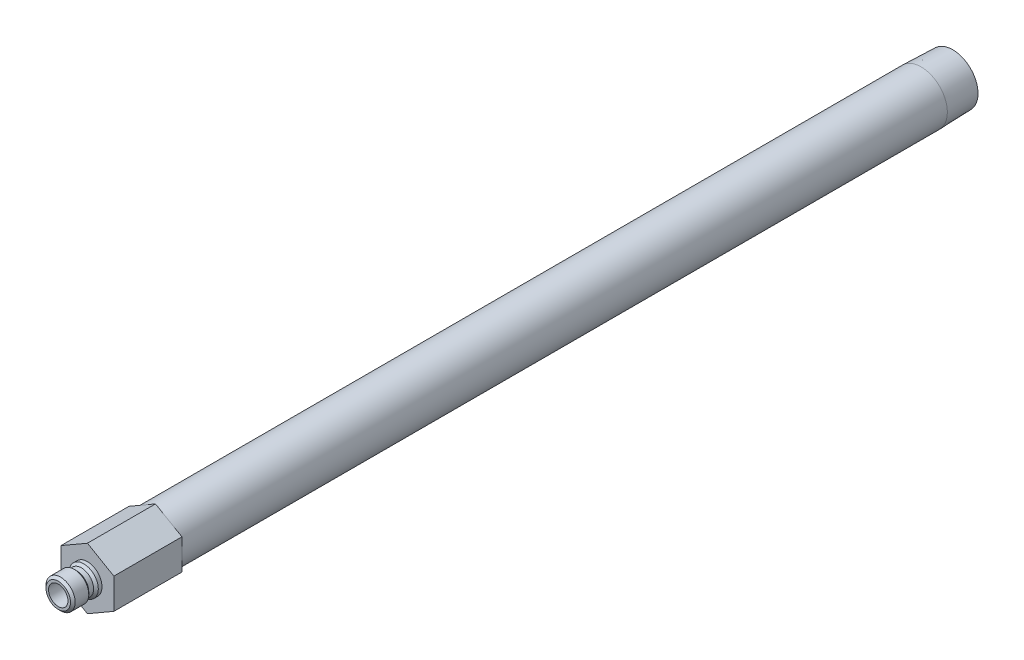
ISO-10303-21;
HEADER;
FILE_DESCRIPTION(('STEP AP214'),'2;1');
FILE_NAME('part.step','',(''),(''),'','','');
FILE_SCHEMA(('AUTOMOTIVE_DESIGN { 1 0 10303 214 1 1 1 1 }'));
ENDSEC;
DATA;
#1=APPLICATION_CONTEXT('core data for automotive mechanical design processes');
#2=APPLICATION_PROTOCOL_DEFINITION('international standard','automotive_design',2000,#1);
#3=PRODUCT_CONTEXT('',#1,'mechanical');
#4=PRODUCT('Part','Part','',(#3));
#5=PRODUCT_RELATED_PRODUCT_CATEGORY('part','',(#4));
#6=PRODUCT_DEFINITION_FORMATION('','',#4);
#7=PRODUCT_DEFINITION_CONTEXT('part definition',#1,'design');
#8=PRODUCT_DEFINITION('design','',#6,#7);
#9=PRODUCT_DEFINITION_SHAPE('','',#8);
#10=(LENGTH_UNIT() NAMED_UNIT(*) SI_UNIT(.MILLI.,.METRE.));
#11=(NAMED_UNIT(*) PLANE_ANGLE_UNIT() SI_UNIT($,.RADIAN.));
#12=(NAMED_UNIT(*) SI_UNIT($,.STERADIAN.) SOLID_ANGLE_UNIT());
#13=UNCERTAINTY_MEASURE_WITH_UNIT(LENGTH_MEASURE(1.E-05),#10,'distance_accuracy_value','');
#14=(GEOMETRIC_REPRESENTATION_CONTEXT(3) GLOBAL_UNCERTAINTY_ASSIGNED_CONTEXT((#13)) GLOBAL_UNIT_ASSIGNED_CONTEXT((#10,
#11,#12)) REPRESENTATION_CONTEXT('',''));
#15=CARTESIAN_POINT('',(0.,0.,0.));
#16=DIRECTION('',(0.,0.,1.));
#17=DIRECTION('',(1.,0.,0.));
#18=AXIS2_PLACEMENT_3D('',#15,#16,#17);
#19=CARTESIAN_POINT('',(0.,0.,0.));
#20=DIRECTION('',(0.,0.,-1.));
#21=DIRECTION('',(0.,1.,0.));
#22=AXIS2_PLACEMENT_3D('',#19,#20,#21);
#23=CYLINDRICAL_SURFACE('',#22,8.57249999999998);
#24=CARTESIAN_POINT('',(0.,0.,-272.2372));
#25=DIRECTION('',(0.,0.,-1.));
#26=DIRECTION('',(0.,1.,0.));
#27=AXIS2_PLACEMENT_3D('',#24,#25,#26);
#28=CIRCLE('',#27,8.57249999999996);
#29=CARTESIAN_POINT('',(0.,8.5725,-272.2372));
#30=VERTEX_POINT('',#29);
#31=EDGE_CURVE('E168',#30,#30,#28,.T.);
#32=ORIENTED_EDGE('',*,*,#31,.F.);
#33=EDGE_LOOP('',(#32));
#34=FACE_BOUND('',#33,.T.);
#35=CARTESIAN_POINT('',(0.,0.,-22.225));
#36=DIRECTION('',(0.,0.,1.));
#37=DIRECTION('',(1.,0.,0.));
#38=AXIS2_PLACEMENT_3D('',#35,#36,#37);
#39=CIRCLE('',#38,8.57249999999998);
#40=CARTESIAN_POINT('',(8.57249999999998,0.,-22.225));
#41=VERTEX_POINT('',#40);
#42=EDGE_CURVE('E37',#41,#41,#39,.F.);
#43=ORIENTED_EDGE('',*,*,#42,.T.);
#44=EDGE_LOOP('',(#43));
#45=FACE_BOUND('',#44,.T.);
#46=ADVANCED_FACE('F33',(#34,#45),#23,.T.);
#47=CARTESIAN_POINT('',(0.,0.,0.));
#48=DIRECTION('',(0.,0.,-1.));
#49=DIRECTION('',(0.,1.,0.));
#50=AXIS2_PLACEMENT_3D('',#47,#48,#49);
#51=CYLINDRICAL_SURFACE('',#50,3.175);
#52=CARTESIAN_POINT('',(0.,0.,9.525));
#53=DIRECTION('',(0.,0.,-1.));
#54=DIRECTION('',(0.,1.,0.));
#55=AXIS2_PLACEMENT_3D('',#52,#53,#54);
#56=CIRCLE('',#55,3.175);
#57=CARTESIAN_POINT('',(0.,3.175,9.525));
#58=VERTEX_POINT('',#57);
#59=EDGE_CURVE('E144',#58,#58,#56,.T.);
#60=ORIENTED_EDGE('',*,*,#59,.F.);
#61=EDGE_LOOP('',(#60));
#62=FACE_BOUND('',#61,.T.);
#63=CARTESIAN_POINT('',(0.,0.,-22.225));
#64=DIRECTION('',(0.,0.,-1.));
#65=DIRECTION('',(0.,1.,0.));
#66=AXIS2_PLACEMENT_3D('',#63,#64,#65);
#67=CIRCLE('',#66,3.17499999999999);
#68=CARTESIAN_POINT('',(0.,3.175,-22.225));
#69=VERTEX_POINT('',#68);
#70=EDGE_CURVE('E11',#69,#69,#67,.T.);
#71=ORIENTED_EDGE('',*,*,#70,.T.);
#72=EDGE_LOOP('',(#71));
#73=FACE_BOUND('',#72,.T.);
#74=ADVANCED_FACE('F35',(#62,#73),#51,.F.);
#75=CARTESIAN_POINT('',(0.,3.175,-22.225));
#76=DIRECTION('',(0.,0.,-1.));
#77=DIRECTION('',(0.,1.,0.));
#78=AXIS2_PLACEMENT_3D('',#75,#76,#77);
#79=PLANE('',#78);
#80=CARTESIAN_POINT('',(0.,0.,-22.225));
#81=DIRECTION('',(0.,0.,-1.));
#82=DIRECTION('',(0.,1.,0.));
#83=AXIS2_PLACEMENT_3D('',#80,#81,#82);
#84=CIRCLE('',#83,6.2611);
#85=CARTESIAN_POINT('',(0.,6.2611,-22.225));
#86=VERTEX_POINT('',#85);
#87=EDGE_CURVE('E43',#86,#86,#84,.T.);
#88=ORIENTED_EDGE('',*,*,#87,.T.);
#89=EDGE_LOOP('',(#88));
#90=FACE_BOUND('',#89,.T.);
#91=ORIENTED_EDGE('',*,*,#70,.F.);
#92=EDGE_LOOP('',(#91));
#93=FACE_BOUND('',#92,.T.);
#94=ADVANCED_FACE('F180',(#90,#93),#79,.T.);
#95=CARTESIAN_POINT('',(0.,0.,0.));
#96=DIRECTION('',(0.,0.,-1.));
#97=DIRECTION('',(0.,1.,0.));
#98=AXIS2_PLACEMENT_3D('',#95,#96,#97);
#99=CYLINDRICAL_SURFACE('',#98,6.26109999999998);
#100=CARTESIAN_POINT('',(0.,0.,-282.575));
#101=DIRECTION('',(0.,0.,-1.));
#102=DIRECTION('',(0.,1.,0.));
#103=AXIS2_PLACEMENT_3D('',#100,#101,#102);
#104=CIRCLE('',#103,6.26109999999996);
#105=CARTESIAN_POINT('',(0.,6.2611,-282.575));
#106=VERTEX_POINT('',#105);
#107=EDGE_CURVE('E174',#106,#106,#104,.T.);
#108=ORIENTED_EDGE('',*,*,#107,.T.);
#109=EDGE_LOOP('',(#108));
#110=FACE_BOUND('',#109,.T.);
#111=ORIENTED_EDGE('',*,*,#87,.F.);
#112=EDGE_LOOP('',(#111));
#113=FACE_BOUND('',#112,.T.);
#114=ADVANCED_FACE('F183',(#110,#113),#99,.F.);
#115=CARTESIAN_POINT('',(0.,8.24944566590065,-282.575));
#116=DIRECTION('',(0.,0.,-1.));
#117=DIRECTION('',(0.,1.,0.));
#118=AXIS2_PLACEMENT_3D('',#115,#116,#117);
#119=PLANE('',#118);
#120=CARTESIAN_POINT('',(0.,0.,-282.575));
#121=DIRECTION('',(0.,0.,-1.));
#122=DIRECTION('',(0.,1.,0.));
#123=AXIS2_PLACEMENT_3D('',#120,#121,#122);
#124=CIRCLE('',#123,8.24944566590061);
#125=CARTESIAN_POINT('',(0.,8.24944566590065,-282.575));
#126=VERTEX_POINT('',#125);
#127=EDGE_CURVE('E171',#126,#126,#124,.T.);
#128=ORIENTED_EDGE('',*,*,#127,.T.);
#129=EDGE_LOOP('',(#128));
#130=FACE_BOUND('',#129,.T.);
#131=ORIENTED_EDGE('',*,*,#107,.F.);
#132=EDGE_LOOP('',(#131));
#133=FACE_BOUND('',#132,.T.);
#134=ADVANCED_FACE('F185',(#130,#133),#119,.T.);
#135=CARTESIAN_POINT('',(0.,0.,-282.575));
#136=DIRECTION('',(0.,0.,1.));
#137=DIRECTION('',(0.,-1.,0.));
#138=AXIS2_PLACEMENT_3D('',#135,#136,#137);
#139=CONICAL_SURFACE('',#138,8.24944566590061,0.0312396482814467);
#140=ORIENTED_EDGE('',*,*,#31,.T.);
#141=EDGE_LOOP('',(#140));
#142=FACE_BOUND('',#141,.T.);
#143=ORIENTED_EDGE('',*,*,#127,.F.);
#144=EDGE_LOOP('',(#143));
#145=FACE_BOUND('',#144,.T.);
#146=ADVANCED_FACE('F192',(#142,#145),#139,.T.);
#147=CARTESIAN_POINT('',(0.,4.7625,0.));
#148=DIRECTION('',(0.,0.,1.));
#149=DIRECTION('',(0.,-1.,0.));
#150=AXIS2_PLACEMENT_3D('',#147,#148,#149);
#151=PLANE('',#150);
#152=CARTESIAN_POINT('',(0.,0.,0.));
#153=DIRECTION('',(0.,0.,-1.));
#154=DIRECTION('',(0.,1.,0.));
#155=AXIS2_PLACEMENT_3D('',#152,#153,#154);
#156=CIRCLE('',#155,4.7625);
#157=CARTESIAN_POINT('',(0.,4.7625,0.));
#158=VERTEX_POINT('',#157);
#159=EDGE_CURVE('E165',#158,#158,#156,.T.);
#160=ORIENTED_EDGE('',*,*,#159,.T.);
#161=EDGE_LOOP('',(#160));
#162=FACE_BOUND('',#161,.T.);
#163=DIRECTION('',(-0.866025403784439,-0.5,0.));
#164=VECTOR('',#163,1.);
#165=CARTESIAN_POINT('',(0.,9.97199384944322,0.));
#166=LINE('',#165,#164);
#167=CARTESIAN_POINT('',(0.,9.97199384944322,0.));
#168=VERTEX_POINT('',#167);
#169=CARTESIAN_POINT('',(-8.636,4.98599692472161,0.));
#170=VERTEX_POINT('',#169);
#171=EDGE_CURVE('E122',#168,#170,#166,.T.);
#172=ORIENTED_EDGE('',*,*,#171,.T.);
#173=DIRECTION('',(0.,-1.,0.));
#174=VECTOR('',#173,1.);
#175=CARTESIAN_POINT('',(-8.636,4.98599692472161,0.));
#176=LINE('',#175,#174);
#177=CARTESIAN_POINT('',(-8.636,-4.98599692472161,0.));
#178=VERTEX_POINT('',#177);
#179=EDGE_CURVE('E125',#170,#178,#176,.T.);
#180=ORIENTED_EDGE('',*,*,#179,.T.);
#181=DIRECTION('',(0.866025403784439,-0.5,0.));
#182=VECTOR('',#181,1.);
#183=CARTESIAN_POINT('',(-8.636,-4.98599692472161,0.));
#184=LINE('',#183,#182);
#185=CARTESIAN_POINT('',(0.,-9.97199384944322,0.));
#186=VERTEX_POINT('',#185);
#187=EDGE_CURVE('E128',#178,#186,#184,.T.);
#188=ORIENTED_EDGE('',*,*,#187,.T.);
#189=DIRECTION('',(0.866025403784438,0.5,0.));
#190=VECTOR('',#189,1.);
#191=CARTESIAN_POINT('',(0.,-9.97199384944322,0.));
#192=LINE('',#191,#190);
#193=CARTESIAN_POINT('',(8.636,-4.98599692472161,0.));
#194=VERTEX_POINT('',#193);
#195=EDGE_CURVE('E131',#186,#194,#192,.T.);
#196=ORIENTED_EDGE('',*,*,#195,.T.);
#197=DIRECTION('',(0.,1.,0.));
#198=VECTOR('',#197,1.);
#199=CARTESIAN_POINT('',(8.636,-4.98599692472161,0.));
#200=LINE('',#199,#198);
#201=CARTESIAN_POINT('',(8.636,4.98599692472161,0.));
#202=VERTEX_POINT('',#201);
#203=EDGE_CURVE('E99',#194,#202,#200,.T.);
#204=ORIENTED_EDGE('',*,*,#203,.T.);
#205=DIRECTION('',(-0.866025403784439,0.5,0.));
#206=VECTOR('',#205,1.);
#207=CARTESIAN_POINT('',(8.636,4.98599692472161,0.));
#208=LINE('',#207,#206);
#209=EDGE_CURVE('E134',#202,#168,#208,.T.);
#210=ORIENTED_EDGE('',*,*,#209,.T.);
#211=EDGE_LOOP('',(#172,#180,#188,#196,#204,#210));
#212=FACE_BOUND('',#211,.T.);
#213=ADVANCED_FACE('F206',(#162,#212),#151,.T.);
#214=CARTESIAN_POINT('',(0.,0.,0.));
#215=DIRECTION('',(0.,0.,-1.));
#216=DIRECTION('',(0.,1.,0.));
#217=AXIS2_PLACEMENT_3D('',#214,#215,#216);
#218=CYLINDRICAL_SURFACE('',#217,4.7625);
#219=CARTESIAN_POINT('',(0.,0.,1.2065));
#220=DIRECTION('',(0.,0.,-1.));
#221=DIRECTION('',(0.,1.,0.));
#222=AXIS2_PLACEMENT_3D('',#219,#220,#221);
#223=CIRCLE('',#222,4.7625);
#224=CARTESIAN_POINT('',(0.,4.7625,1.2065));
#225=VERTEX_POINT('',#224);
#226=EDGE_CURVE('E162',#225,#225,#223,.T.);
#227=ORIENTED_EDGE('',*,*,#226,.T.);
#228=EDGE_LOOP('',(#227));
#229=FACE_BOUND('',#228,.T.);
#230=ORIENTED_EDGE('',*,*,#159,.F.);
#231=EDGE_LOOP('',(#230));
#232=FACE_BOUND('',#231,.T.);
#233=ADVANCED_FACE('F213',(#229,#232),#218,.T.);
#234=CARTESIAN_POINT('',(0.,0.,1.2065));
#235=DIRECTION('',(0.,0.,-1.));
#236=DIRECTION('',(0.,1.,0.));
#237=AXIS2_PLACEMENT_3D('',#234,#235,#236);
#238=CONICAL_SURFACE('',#237,4.7625,0.785398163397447);
#239=CARTESIAN_POINT('',(0.,0.,1.9685));
#240=DIRECTION('',(0.,0.,-1.));
#241=DIRECTION('',(0.,1.,0.));
#242=AXIS2_PLACEMENT_3D('',#239,#240,#241);
#243=CIRCLE('',#242,4.0005);
#244=CARTESIAN_POINT('',(0.,4.0005,1.9685));
#245=VERTEX_POINT('',#244);
#246=EDGE_CURVE('E159',#245,#245,#243,.T.);
#247=ORIENTED_EDGE('',*,*,#246,.T.);
#248=EDGE_LOOP('',(#247));
#249=FACE_BOUND('',#248,.T.);
#250=ORIENTED_EDGE('',*,*,#226,.F.);
#251=EDGE_LOOP('',(#250));
#252=FACE_BOUND('',#251,.T.);
#253=ADVANCED_FACE('F222',(#249,#252),#238,.T.);
#254=CARTESIAN_POINT('',(0.,0.,0.));
#255=DIRECTION('',(0.,0.,-1.));
#256=DIRECTION('',(0.,1.,0.));
#257=AXIS2_PLACEMENT_3D('',#254,#255,#256);
#258=CYLINDRICAL_SURFACE('',#257,4.0005);
#259=CARTESIAN_POINT('',(0.,0.,3.556));
#260=DIRECTION('',(0.,0.,-1.));
#261=DIRECTION('',(0.,1.,0.));
#262=AXIS2_PLACEMENT_3D('',#259,#260,#261);
#263=CIRCLE('',#262,4.0005);
#264=CARTESIAN_POINT('',(0.,4.0005,3.556));
#265=VERTEX_POINT('',#264);
#266=EDGE_CURVE('E156',#265,#265,#263,.T.);
#267=ORIENTED_EDGE('',*,*,#266,.T.);
#268=EDGE_LOOP('',(#267));
#269=FACE_BOUND('',#268,.T.);
#270=ORIENTED_EDGE('',*,*,#246,.F.);
#271=EDGE_LOOP('',(#270));
#272=FACE_BOUND('',#271,.T.);
#273=ADVANCED_FACE('F263',(#269,#272),#258,.T.);
#274=CARTESIAN_POINT('',(0.,0.,3.556));
#275=DIRECTION('',(0.,0.,1.));
#276=DIRECTION('',(0.,-1.,0.));
#277=AXIS2_PLACEMENT_3D('',#274,#275,#276);
#278=CONICAL_SURFACE('',#277,4.0005,0.785398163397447);
#279=CARTESIAN_POINT('',(0.,0.,4.318));
#280=DIRECTION('',(0.,0.,-1.));
#281=DIRECTION('',(0.,1.,0.));
#282=AXIS2_PLACEMENT_3D('',#279,#280,#281);
#283=CIRCLE('',#282,4.7625);
#284=CARTESIAN_POINT('',(0.,4.7625,4.318));
#285=VERTEX_POINT('',#284);
#286=EDGE_CURVE('E153',#285,#285,#283,.T.);
#287=ORIENTED_EDGE('',*,*,#286,.T.);
#288=EDGE_LOOP('',(#287));
#289=FACE_BOUND('',#288,.T.);
#290=ORIENTED_EDGE('',*,*,#266,.F.);
#291=EDGE_LOOP('',(#290));
#292=FACE_BOUND('',#291,.T.);
#293=ADVANCED_FACE('F259',(#289,#292),#278,.T.);
#294=CARTESIAN_POINT('',(0.,0.,0.));
#295=DIRECTION('',(0.,0.,-1.));
#296=DIRECTION('',(0.,1.,0.));
#297=AXIS2_PLACEMENT_3D('',#294,#295,#296);
#298=CYLINDRICAL_SURFACE('',#297,4.7625);
#299=CARTESIAN_POINT('',(0.,0.,8.763));
#300=DIRECTION('',(0.,0.,-1.));
#301=DIRECTION('',(0.,1.,0.));
#302=AXIS2_PLACEMENT_3D('',#299,#300,#301);
#303=CIRCLE('',#302,4.7625);
#304=CARTESIAN_POINT('',(0.,4.7625,8.763));
#305=VERTEX_POINT('',#304);
#306=EDGE_CURVE('E150',#305,#305,#303,.T.);
#307=ORIENTED_EDGE('',*,*,#306,.T.);
#308=EDGE_LOOP('',(#307));
#309=FACE_BOUND('',#308,.T.);
#310=ORIENTED_EDGE('',*,*,#286,.F.);
#311=EDGE_LOOP('',(#310));
#312=FACE_BOUND('',#311,.T.);
#313=ADVANCED_FACE('F255',(#309,#312),#298,.T.);
#314=CARTESIAN_POINT('',(0.,0.,8.763));
#315=DIRECTION('',(0.,0.,-1.));
#316=DIRECTION('',(0.,1.,0.));
#317=AXIS2_PLACEMENT_3D('',#314,#315,#316);
#318=CONICAL_SURFACE('',#317,4.7625,0.785398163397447);
#319=CARTESIAN_POINT('',(0.,0.,9.525));
#320=DIRECTION('',(0.,0.,-1.));
#321=DIRECTION('',(0.,1.,0.));
#322=AXIS2_PLACEMENT_3D('',#319,#320,#321);
#323=CIRCLE('',#322,4.0005);
#324=CARTESIAN_POINT('',(0.,4.0005,9.525));
#325=VERTEX_POINT('',#324);
#326=EDGE_CURVE('E147',#325,#325,#323,.T.);
#327=ORIENTED_EDGE('',*,*,#326,.T.);
#328=EDGE_LOOP('',(#327));
#329=FACE_BOUND('',#328,.T.);
#330=ORIENTED_EDGE('',*,*,#306,.F.);
#331=EDGE_LOOP('',(#330));
#332=FACE_BOUND('',#331,.T.);
#333=ADVANCED_FACE('F251',(#329,#332),#318,.T.);
#334=CARTESIAN_POINT('',(0.,3.175,9.525));
#335=DIRECTION('',(0.,0.,1.));
#336=DIRECTION('',(0.,-1.,0.));
#337=AXIS2_PLACEMENT_3D('',#334,#335,#336);
#338=PLANE('',#337);
#339=ORIENTED_EDGE('',*,*,#59,.T.);
#340=EDGE_LOOP('',(#339));
#341=FACE_BOUND('',#340,.T.);
#342=ORIENTED_EDGE('',*,*,#326,.F.);
#343=EDGE_LOOP('',(#342));
#344=FACE_BOUND('',#343,.T.);
#345=ADVANCED_FACE('F239',(#341,#344),#338,.T.);
#346=CARTESIAN_POINT('',(0.,9.97199384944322,-22.225));
#347=DIRECTION('',(-0.5,0.866025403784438,0.));
#348=DIRECTION('',(-0.866025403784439,-0.5,0.));
#349=AXIS2_PLACEMENT_3D('',#346,#347,#348);
#350=PLANE('',#349);
#351=ORIENTED_EDGE('',*,*,#171,.F.);
#352=DIRECTION('',(0.,0.,1.));
#353=VECTOR('',#352,1.);
#354=CARTESIAN_POINT('',(0.,9.97199384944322,-22.225));
#355=LINE('',#354,#353);
#356=CARTESIAN_POINT('',(0.,9.97199384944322,-22.225));
#357=VERTEX_POINT('',#356);
#358=EDGE_CURVE('E51',#357,#168,#355,.T.);
#359=ORIENTED_EDGE('',*,*,#358,.F.);
#360=DIRECTION('',(-0.866025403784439,-0.5,0.));
#361=VECTOR('',#360,1.);
#362=CARTESIAN_POINT('',(0.,9.97199384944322,-22.225));
#363=LINE('',#362,#361);
#364=CARTESIAN_POINT('',(-8.636,4.98599692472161,-22.225));
#365=VERTEX_POINT('',#364);
#366=EDGE_CURVE('E137',#357,#365,#363,.T.);
#367=ORIENTED_EDGE('',*,*,#366,.T.);
#368=DIRECTION('',(0.,0.,1.));
#369=VECTOR('',#368,1.);
#370=CARTESIAN_POINT('',(-8.636,4.98599692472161,-22.225));
#371=LINE('',#370,#369);
#372=EDGE_CURVE('E86',#365,#170,#371,.T.);
#373=ORIENTED_EDGE('',*,*,#372,.T.);
#374=EDGE_LOOP('',(#351,#359,#367,#373));
#375=FACE_BOUND('',#374,.T.);
#376=ADVANCED_FACE('F226',(#375),#350,.T.);
#377=CARTESIAN_POINT('',(8.636,4.98599692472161,-22.225));
#378=DIRECTION('',(0.5,0.866025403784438,0.));
#379=DIRECTION('',(-0.866025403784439,0.5,0.));
#380=AXIS2_PLACEMENT_3D('',#377,#378,#379);
#381=PLANE('',#380);
#382=ORIENTED_EDGE('',*,*,#209,.F.);
#383=DIRECTION('',(0.,0.,1.));
#384=VECTOR('',#383,1.);
#385=CARTESIAN_POINT('',(8.636,4.98599692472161,-22.225));
#386=LINE('',#385,#384);
#387=CARTESIAN_POINT('',(8.636,4.98599692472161,-22.225));
#388=VERTEX_POINT('',#387);
#389=EDGE_CURVE('E74',#388,#202,#386,.T.);
#390=ORIENTED_EDGE('',*,*,#389,.F.);
#391=DIRECTION('',(-0.866025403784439,0.5,0.));
#392=VECTOR('',#391,1.);
#393=CARTESIAN_POINT('',(8.636,4.98599692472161,-22.225));
#394=LINE('',#393,#392);
#395=EDGE_CURVE('E112',#388,#357,#394,.T.);
#396=ORIENTED_EDGE('',*,*,#395,.T.);
#397=ORIENTED_EDGE('',*,*,#358,.T.);
#398=EDGE_LOOP('',(#382,#390,#396,#397));
#399=FACE_BOUND('',#398,.T.);
#400=ADVANCED_FACE('F231',(#399),#381,.T.);
#401=CARTESIAN_POINT('',(8.636,-4.98599692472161,-22.225));
#402=DIRECTION('',(1.,0.,0.));
#403=DIRECTION('',(0.,1.,0.));
#404=AXIS2_PLACEMENT_3D('',#401,#402,#403);
#405=PLANE('',#404);
#406=ORIENTED_EDGE('',*,*,#203,.F.);
#407=DIRECTION('',(0.,0.,1.));
#408=VECTOR('',#407,1.);
#409=CARTESIAN_POINT('',(8.636,-4.98599692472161,-22.225));
#410=LINE('',#409,#408);
#411=CARTESIAN_POINT('',(8.636,-4.98599692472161,-22.225));
#412=VERTEX_POINT('',#411);
#413=EDGE_CURVE('E94',#412,#194,#410,.T.);
#414=ORIENTED_EDGE('',*,*,#413,.F.);
#415=DIRECTION('',(0.,1.,0.));
#416=VECTOR('',#415,1.);
#417=CARTESIAN_POINT('',(8.636,-4.98599692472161,-22.225));
#418=LINE('',#417,#416);
#419=EDGE_CURVE('E97',#412,#388,#418,.T.);
#420=ORIENTED_EDGE('',*,*,#419,.T.);
#421=ORIENTED_EDGE('',*,*,#389,.T.);
#422=EDGE_LOOP('',(#406,#414,#420,#421));
#423=FACE_BOUND('',#422,.T.);
#424=ADVANCED_FACE('F96',(#423),#405,.T.);
#425=CARTESIAN_POINT('',(0.,-9.97199384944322,-22.225));
#426=DIRECTION('',(0.5,-0.866025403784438,0.));
#427=DIRECTION('',(0.866025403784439,0.5,0.));
#428=AXIS2_PLACEMENT_3D('',#425,#426,#427);
#429=PLANE('',#428);
#430=ORIENTED_EDGE('',*,*,#195,.F.);
#431=DIRECTION('',(0.,0.,1.));
#432=VECTOR('',#431,1.);
#433=CARTESIAN_POINT('',(0.,-9.97199384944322,-22.225));
#434=LINE('',#433,#432);
#435=CARTESIAN_POINT('',(0.,-9.97199384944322,-22.225));
#436=VERTEX_POINT('',#435);
#437=EDGE_CURVE('E104',#436,#186,#434,.T.);
#438=ORIENTED_EDGE('',*,*,#437,.F.);
#439=DIRECTION('',(0.866025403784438,0.5,0.));
#440=VECTOR('',#439,1.);
#441=CARTESIAN_POINT('',(0.,-9.97199384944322,-22.225));
#442=LINE('',#441,#440);
#443=EDGE_CURVE('E110',#436,#412,#442,.T.);
#444=ORIENTED_EDGE('',*,*,#443,.T.);
#445=ORIENTED_EDGE('',*,*,#413,.T.);
#446=EDGE_LOOP('',(#430,#438,#444,#445));
#447=FACE_BOUND('',#446,.T.);
#448=ADVANCED_FACE('F114',(#447),#429,.T.);
#449=CARTESIAN_POINT('',(-8.636,-4.98599692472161,-22.225));
#450=DIRECTION('',(-0.5,-0.866025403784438,0.));
#451=DIRECTION('',(0.866025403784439,-0.5,0.));
#452=AXIS2_PLACEMENT_3D('',#449,#450,#451);
#453=PLANE('',#452);
#454=ORIENTED_EDGE('',*,*,#187,.F.);
#455=DIRECTION('',(0.,0.,1.));
#456=VECTOR('',#455,1.);
#457=CARTESIAN_POINT('',(-8.636,-4.98599692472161,-22.225));
#458=LINE('',#457,#456);
#459=CARTESIAN_POINT('',(-8.636,-4.98599692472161,-22.225));
#460=VERTEX_POINT('',#459);
#461=EDGE_CURVE('E141',#460,#178,#458,.T.);
#462=ORIENTED_EDGE('',*,*,#461,.F.);
#463=DIRECTION('',(0.866025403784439,-0.5,0.));
#464=VECTOR('',#463,1.);
#465=CARTESIAN_POINT('',(-8.636,-4.98599692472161,-22.225));
#466=LINE('',#465,#464);
#467=EDGE_CURVE('E115',#460,#436,#466,.T.);
#468=ORIENTED_EDGE('',*,*,#467,.T.);
#469=ORIENTED_EDGE('',*,*,#437,.T.);
#470=EDGE_LOOP('',(#454,#462,#468,#469));
#471=FACE_BOUND('',#470,.T.);
#472=ADVANCED_FACE('F230',(#471),#453,.T.);
#473=CARTESIAN_POINT('',(-8.636,4.98599692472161,-22.225));
#474=DIRECTION('',(-1.,0.,0.));
#475=DIRECTION('',(0.,0.,1.));
#476=AXIS2_PLACEMENT_3D('',#473,#474,#475);
#477=PLANE('',#476);
#478=ORIENTED_EDGE('',*,*,#179,.F.);
#479=ORIENTED_EDGE('',*,*,#372,.F.);
#480=DIRECTION('',(0.,-1.,0.));
#481=VECTOR('',#480,1.);
#482=CARTESIAN_POINT('',(-8.636,4.98599692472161,-22.225));
#483=LINE('',#482,#481);
#484=EDGE_CURVE('E117',#365,#460,#483,.T.);
#485=ORIENTED_EDGE('',*,*,#484,.T.);
#486=ORIENTED_EDGE('',*,*,#461,.T.);
#487=EDGE_LOOP('',(#478,#479,#485,#486));
#488=FACE_BOUND('',#487,.T.);
#489=ADVANCED_FACE('F227',(#488),#477,.T.);
#490=CARTESIAN_POINT('',(-8.636,4.98599692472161,-22.225));
#491=DIRECTION('',(0.,0.,1.));
#492=DIRECTION('',(1.,0.,0.));
#493=AXIS2_PLACEMENT_3D('',#490,#491,#492);
#494=PLANE('',#493);
#495=ORIENTED_EDGE('',*,*,#42,.F.);
#496=EDGE_LOOP('',(#495));
#497=FACE_BOUND('',#496,.T.);
#498=ORIENTED_EDGE('',*,*,#366,.F.);
#499=ORIENTED_EDGE('',*,*,#395,.F.);
#500=ORIENTED_EDGE('',*,*,#419,.F.);
#501=ORIENTED_EDGE('',*,*,#443,.F.);
#502=ORIENTED_EDGE('',*,*,#467,.F.);
#503=ORIENTED_EDGE('',*,*,#484,.F.);
#504=EDGE_LOOP('',(#498,#499,#500,#501,#502,#503));
#505=FACE_BOUND('',#504,.T.);
#506=ADVANCED_FACE('F108',(#497,#505),#494,.F.);
#507=CLOSED_SHELL('',(#46,#74,#94,#114,#134,#146,#213,#233,#253,#273,#293,#313,#333,#345,#376,
#400,#424,#448,#472,#489,#506));
#508=MANIFOLD_SOLID_BREP('B2',#507);
#509=ADVANCED_BREP_SHAPE_REPRESENTATION('',(#18,#508),#14);
#510=SHAPE_DEFINITION_REPRESENTATION(#9,#509);
ENDSEC;
END-ISO-10303-21;
